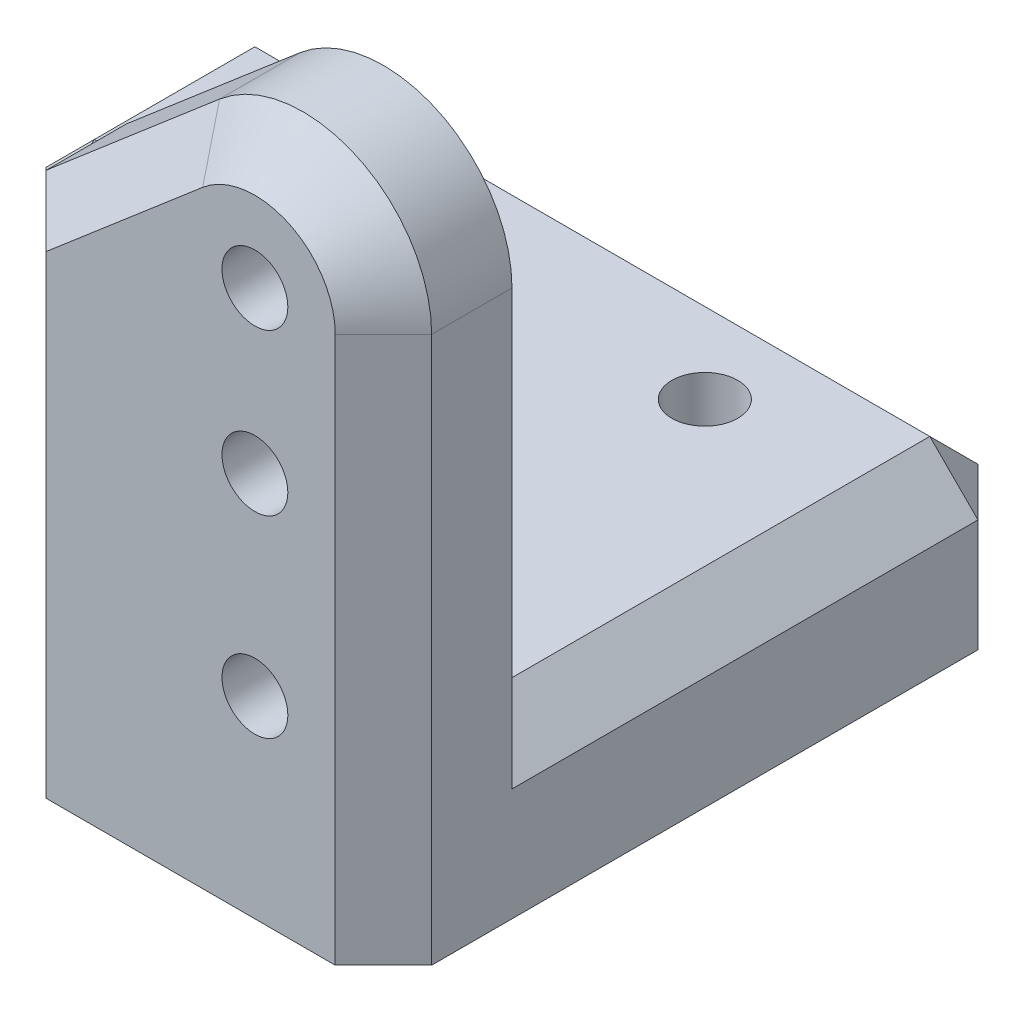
ISO-10303-21;
HEADER;
FILE_DESCRIPTION(('STEP AP214'),'2;1');
FILE_NAME('part.step','',(''),(''),'','','');
FILE_SCHEMA(('AUTOMOTIVE_DESIGN { 1 0 10303 214 1 1 1 1 }'));
ENDSEC;
DATA;
#1=APPLICATION_CONTEXT('core data for automotive mechanical design processes');
#2=APPLICATION_PROTOCOL_DEFINITION('international standard','automotive_design',2000,#1);
#3=PRODUCT_CONTEXT('',#1,'mechanical');
#4=PRODUCT('Part','Part','',(#3));
#5=PRODUCT_RELATED_PRODUCT_CATEGORY('part','',(#4));
#6=PRODUCT_DEFINITION_FORMATION('','',#4);
#7=PRODUCT_DEFINITION_CONTEXT('part definition',#1,'design');
#8=PRODUCT_DEFINITION('design','',#6,#7);
#9=PRODUCT_DEFINITION_SHAPE('','',#8);
#10=(LENGTH_UNIT() NAMED_UNIT(*) SI_UNIT(.MILLI.,.METRE.));
#11=(NAMED_UNIT(*) PLANE_ANGLE_UNIT() SI_UNIT($,.RADIAN.));
#12=(NAMED_UNIT(*) SI_UNIT($,.STERADIAN.) SOLID_ANGLE_UNIT());
#13=UNCERTAINTY_MEASURE_WITH_UNIT(LENGTH_MEASURE(1.E-05),#10,'distance_accuracy_value','');
#14=(GEOMETRIC_REPRESENTATION_CONTEXT(3) GLOBAL_UNCERTAINTY_ASSIGNED_CONTEXT((#13)) GLOBAL_UNIT_ASSIGNED_CONTEXT((#10,
#11,#12)) REPRESENTATION_CONTEXT('',''));
#15=CARTESIAN_POINT('',(0.,0.,0.));
#16=DIRECTION('',(0.,0.,1.));
#17=DIRECTION('',(1.,0.,0.));
#18=AXIS2_PLACEMENT_3D('',#15,#16,#17);
#19=CARTESIAN_POINT('',(12.,17.,20.));
#20=DIRECTION('',(0.,0.,-1.));
#21=DIRECTION('',(-1.,0.,0.));
#22=AXIS2_PLACEMENT_3D('',#19,#20,#21);
#23=PLANE('',#22);
#24=CARTESIAN_POINT('',(12.,6.,20.));
#25=DIRECTION('',(0.,0.,1.));
#26=DIRECTION('',(1.,0.,0.));
#27=AXIS2_PLACEMENT_3D('',#24,#25,#26);
#28=CIRCLE('',#27,1.025);
#29=CARTESIAN_POINT('',(13.025,6.,20.));
#30=VERTEX_POINT('',#29);
#31=EDGE_CURVE('E189',#30,#30,#28,.T.);
#32=ORIENTED_EDGE('',*,*,#31,.F.);
#33=EDGE_LOOP('',(#32));
#34=FACE_BOUND('',#33,.T.);
#35=CARTESIAN_POINT('',(12.,17.,20.));
#36=DIRECTION('',(0.,0.,1.));
#37=DIRECTION('',(1.,0.,0.));
#38=AXIS2_PLACEMENT_3D('',#35,#36,#37);
#39=CIRCLE('',#38,1.025);
#40=CARTESIAN_POINT('',(13.025,17.,20.));
#41=VERTEX_POINT('',#40);
#42=EDGE_CURVE('E354',#41,#41,#39,.T.);
#43=ORIENTED_EDGE('',*,*,#42,.F.);
#44=EDGE_LOOP('',(#43));
#45=FACE_BOUND('',#44,.T.);
#46=DIRECTION('',(1.,0.,0.));
#47=VECTOR('',#46,1.);
#48=CARTESIAN_POINT('',(16.,0.,20.));
#49=LINE('',#48,#47);
#50=CARTESIAN_POINT('',(5.50000000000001,0.,20.));
#51=VERTEX_POINT('',#50);
#52=CARTESIAN_POINT('',(14.5,0.,20.));
#53=VERTEX_POINT('',#52);
#54=EDGE_CURVE('E213',#51,#53,#49,.T.);
#55=ORIENTED_EDGE('',*,*,#54,.T.);
#56=DIRECTION('',(0.,1.,0.));
#57=VECTOR('',#56,1.);
#58=CARTESIAN_POINT('',(14.5,17.,20.));
#59=LINE('',#58,#57);
#60=CARTESIAN_POINT('',(14.5,17.,20.));
#61=VERTEX_POINT('',#60);
#62=EDGE_CURVE('E231',#53,#61,#59,.T.);
#63=ORIENTED_EDGE('',*,*,#62,.T.);
#64=CARTESIAN_POINT('',(12.,17.,20.));
#65=DIRECTION('',(0.,0.,-1.));
#66=DIRECTION('',(-1.,0.,0.));
#67=AXIS2_PLACEMENT_3D('',#64,#65,#66);
#68=CIRCLE('',#67,2.49999999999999);
#69=CARTESIAN_POINT('',(10.37505052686,18.899878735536,20.));
#70=VERTEX_POINT('',#69);
#71=EDGE_CURVE('E229',#61,#70,#68,.F.);
#72=ORIENTED_EDGE('',*,*,#71,.T.);
#73=DIRECTION('',(-0.759951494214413,-0.649979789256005,0.));
#74=VECTOR('',#73,1.);
#75=CARTESIAN_POINT('',(10.37505052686,18.899878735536,20.));
#76=LINE('',#75,#74);
#77=CARTESIAN_POINT('',(5.50000000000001,14.7302911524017,20.));
#78=VERTEX_POINT('',#77);
#79=EDGE_CURVE('E227',#70,#78,#76,.T.);
#80=ORIENTED_EDGE('',*,*,#79,.T.);
#81=DIRECTION('',(0.,-1.,0.));
#82=VECTOR('',#81,1.);
#83=CARTESIAN_POINT('',(5.50000000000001,17.,20.));
#84=LINE('',#83,#82);
#85=EDGE_CURVE('E225',#78,#51,#84,.T.);
#86=ORIENTED_EDGE('',*,*,#85,.T.);
#87=EDGE_LOOP('',(#55,#63,#72,#80,#86));
#88=FACE_BOUND('',#87,.T.);
#89=CARTESIAN_POINT('',(12.,12.,20.));
#90=DIRECTION('',(0.,0.,1.));
#91=DIRECTION('',(1.,0.,0.));
#92=AXIS2_PLACEMENT_3D('',#89,#90,#91);
#93=CIRCLE('',#92,1.025);
#94=CARTESIAN_POINT('',(13.025,12.,20.));
#95=VERTEX_POINT('',#94);
#96=EDGE_CURVE('E188',#95,#95,#93,.T.);
#97=ORIENTED_EDGE('',*,*,#96,.F.);
#98=EDGE_LOOP('',(#97));
#99=FACE_BOUND('',#98,.T.);
#100=ADVANCED_FACE('F40',(#34,#45,#88,#99),#23,.F.);
#101=CARTESIAN_POINT('',(-4.,5.,0.));
#102=DIRECTION('',(0.,-1.,0.));
#103=DIRECTION('',(0.,0.,-1.));
#104=AXIS2_PLACEMENT_3D('',#101,#102,#103);
#105=PLANE('',#104);
#106=CARTESIAN_POINT('',(-2.,5.,4.00000000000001));
#107=DIRECTION('',(0.,-1.,0.));
#108=DIRECTION('',(0.,0.,-1.));
#109=AXIS2_PLACEMENT_3D('',#106,#107,#108);
#110=CIRCLE('',#109,1.02499999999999);
#111=CARTESIAN_POINT('',(-2.,5.,2.97500000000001));
#112=VERTEX_POINT('',#111);
#113=EDGE_CURVE('E882',#112,#112,#110,.T.);
#114=ORIENTED_EDGE('',*,*,#113,.T.);
#115=EDGE_LOOP('',(#114));
#116=FACE_BOUND('',#115,.T.);
#117=CARTESIAN_POINT('',(10.,5.,4.00000000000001));
#118=DIRECTION('',(0.,-1.,0.));
#119=DIRECTION('',(0.,0.,-1.));
#120=AXIS2_PLACEMENT_3D('',#117,#118,#119);
#121=CIRCLE('',#120,1.02499999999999);
#122=CARTESIAN_POINT('',(10.,5.,2.97500000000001));
#123=VERTEX_POINT('',#122);
#124=EDGE_CURVE('E888',#123,#123,#121,.T.);
#125=ORIENTED_EDGE('',*,*,#124,.T.);
#126=EDGE_LOOP('',(#125));
#127=FACE_BOUND('',#126,.T.);
#128=CARTESIAN_POINT('',(10.,5.,14.));
#129=DIRECTION('',(0.,-1.,0.));
#130=DIRECTION('',(0.,0.,-1.));
#131=AXIS2_PLACEMENT_3D('',#128,#129,#130);
#132=CIRCLE('',#131,1.02499999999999);
#133=CARTESIAN_POINT('',(10.,5.,12.975));
#134=VERTEX_POINT('',#133);
#135=EDGE_CURVE('E313',#134,#134,#132,.T.);
#136=ORIENTED_EDGE('',*,*,#135,.T.);
#137=EDGE_LOOP('',(#136));
#138=FACE_BOUND('',#137,.T.);
#139=DIRECTION('',(1.,0.,0.));
#140=VECTOR('',#139,1.);
#141=CARTESIAN_POINT('',(-4.,5.,16.));
#142=LINE('',#141,#140);
#143=CARTESIAN_POINT('',(5.50000000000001,5.,16.));
#144=VERTEX_POINT('',#143);
#145=CARTESIAN_POINT('',(11.775,5.,16.));
#146=VERTEX_POINT('',#145);
#147=EDGE_CURVE('E201',#144,#146,#142,.T.);
#148=ORIENTED_EDGE('',*,*,#147,.T.);
#149=CARTESIAN_POINT('',(12.225,5.,16.));
#150=VERTEX_POINT('',#149);
#151=EDGE_CURVE('E187',#146,#150,#142,.T.);
#152=ORIENTED_EDGE('',*,*,#151,.T.);
#153=CARTESIAN_POINT('',(14.5,5.,16.));
#154=VERTEX_POINT('',#153);
#155=EDGE_CURVE('E192',#150,#154,#142,.T.);
#156=ORIENTED_EDGE('',*,*,#155,.T.);
#157=DIRECTION('',(0.,0.,-1.));
#158=VECTOR('',#157,1.);
#159=CARTESIAN_POINT('',(14.5,5.,0.));
#160=LINE('',#159,#158);
#161=CARTESIAN_POINT('',(14.5,5.,1.5));
#162=VERTEX_POINT('',#161);
#163=EDGE_CURVE('E271',#154,#162,#160,.T.);
#164=ORIENTED_EDGE('',*,*,#163,.T.);
#165=DIRECTION('',(-1.,0.,0.));
#166=VECTOR('',#165,1.);
#167=CARTESIAN_POINT('',(-8.,5.,1.5));
#168=LINE('',#167,#166);
#169=CARTESIAN_POINT('',(-6.50000000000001,5.,1.5));
#170=VERTEX_POINT('',#169);
#171=EDGE_CURVE('E269',#162,#170,#168,.T.);
#172=ORIENTED_EDGE('',*,*,#171,.T.);
#173=DIRECTION('',(0.,0.,1.));
#174=VECTOR('',#173,1.);
#175=CARTESIAN_POINT('',(-6.50000000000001,5.,0.));
#176=LINE('',#175,#174);
#177=CARTESIAN_POINT('',(-6.50000000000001,5.,6.50000000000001));
#178=VERTEX_POINT('',#177);
#179=EDGE_CURVE('E267',#170,#178,#176,.T.);
#180=ORIENTED_EDGE('',*,*,#179,.T.);
#181=DIRECTION('',(1.,0.,0.));
#182=VECTOR('',#181,1.);
#183=CARTESIAN_POINT('',(-4.,5.,6.50000000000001));
#184=LINE('',#183,#182);
#185=CARTESIAN_POINT('',(2.5,5.,6.50000000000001));
#186=VERTEX_POINT('',#185);
#187=EDGE_CURVE('E265',#178,#186,#184,.T.);
#188=ORIENTED_EDGE('',*,*,#187,.T.);
#189=DIRECTION('',(-0.707106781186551,0.,-0.707106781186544));
#190=VECTOR('',#189,1.);
#191=CARTESIAN_POINT('',(2.5,5.,6.50000000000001));
#192=LINE('',#191,#190);
#193=CARTESIAN_POINT('',(4.,5.,8.));
#194=VERTEX_POINT('',#193);
#195=EDGE_CURVE('E262',#194,#186,#192,.T.);
#196=ORIENTED_EDGE('',*,*,#195,.F.);
#197=DIRECTION('',(-0.707106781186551,0.,-0.707106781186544));
#198=VECTOR('',#197,1.);
#199=CARTESIAN_POINT('',(2.5,5.,6.50000000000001));
#200=LINE('',#199,#198);
#201=CARTESIAN_POINT('',(5.50000000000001,5.,9.49999999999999));
#202=VERTEX_POINT('',#201);
#203=EDGE_CURVE('E259',#202,#194,#200,.T.);
#204=ORIENTED_EDGE('',*,*,#203,.F.);
#205=DIRECTION('',(0.,0.,1.));
#206=VECTOR('',#205,1.);
#207=CARTESIAN_POINT('',(5.50000000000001,5.,0.));
#208=LINE('',#207,#206);
#209=EDGE_CURVE('E247',#202,#144,#208,.T.);
#210=ORIENTED_EDGE('',*,*,#209,.T.);
#211=EDGE_LOOP('',(#148,#152,#156,#164,#172,#180,#188,#196,#204,#210));
#212=FACE_BOUND('',#211,.T.);
#213=ADVANCED_FACE('F202',(#116,#127,#138,#212),#105,.F.);
#214=CARTESIAN_POINT('',(4.,0.,0.));
#215=DIRECTION('',(1.,0.,0.));
#216=DIRECTION('',(0.,0.,-1.));
#217=AXIS2_PLACEMENT_3D('',#214,#215,#216);
#218=PLANE('',#217);
#219=DIRECTION('',(0.,1.,0.));
#220=VECTOR('',#219,1.);
#221=CARTESIAN_POINT('',(4.,5.,16.));
#222=LINE('',#221,#220);
#223=CARTESIAN_POINT('',(4.,3.50000000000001,16.));
#224=VERTEX_POINT('',#223);
#225=CARTESIAN_POINT('',(4.,15.4211646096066,16.));
#226=VERTEX_POINT('',#225);
#227=EDGE_CURVE('E63',#224,#226,#222,.T.);
#228=ORIENTED_EDGE('',*,*,#227,.F.);
#229=DIRECTION('',(0.,0.,-1.));
#230=VECTOR('',#229,1.);
#231=CARTESIAN_POINT('',(4.,3.50000000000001,0.));
#232=LINE('',#231,#230);
#233=CARTESIAN_POINT('',(4.,3.50000000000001,9.49999999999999));
#234=VERTEX_POINT('',#233);
#235=EDGE_CURVE('E304',#224,#234,#232,.T.);
#236=ORIENTED_EDGE('',*,*,#235,.T.);
#237=DIRECTION('',(0.,-1.,0.));
#238=VECTOR('',#237,1.);
#239=CARTESIAN_POINT('',(4.,0.,9.49999999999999));
#240=LINE('',#239,#238);
#241=CARTESIAN_POINT('',(4.,0.,9.49999999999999));
#242=VERTEX_POINT('',#241);
#243=EDGE_CURVE('E302',#234,#242,#240,.T.);
#244=ORIENTED_EDGE('',*,*,#243,.T.);
#245=DIRECTION('',(0.,0.,1.));
#246=VECTOR('',#245,1.);
#247=CARTESIAN_POINT('',(4.,0.,0.));
#248=LINE('',#247,#246);
#249=CARTESIAN_POINT('',(4.,0.,18.5));
#250=VERTEX_POINT('',#249);
#251=EDGE_CURVE('E257',#242,#250,#248,.T.);
#252=ORIENTED_EDGE('',*,*,#251,.T.);
#253=DIRECTION('',(0.,1.,0.));
#254=VECTOR('',#253,1.);
#255=CARTESIAN_POINT('',(4.,0.,18.5));
#256=LINE('',#255,#254);
#257=CARTESIAN_POINT('',(4.,15.4211646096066,18.5));
#258=VERTEX_POINT('',#257);
#259=EDGE_CURVE('E245',#250,#258,#256,.T.);
#260=ORIENTED_EDGE('',*,*,#259,.T.);
#261=DIRECTION('',(0.,0.,1.));
#262=VECTOR('',#261,1.);
#263=CARTESIAN_POINT('',(4.,15.4211646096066,0.));
#264=LINE('',#263,#262);
#265=EDGE_CURVE('E363',#226,#258,#264,.T.);
#266=ORIENTED_EDGE('',*,*,#265,.F.);
#267=EDGE_LOOP('',(#228,#236,#244,#252,#260,#266));
#268=FACE_BOUND('',#267,.T.);
#269=ADVANCED_FACE('F428',(#268),#218,.F.);
#270=CARTESIAN_POINT('',(16.,0.,20.));
#271=DIRECTION('',(0.,1.,0.));
#272=DIRECTION('',(0.,0.,1.));
#273=AXIS2_PLACEMENT_3D('',#270,#271,#272);
#274=PLANE('',#273);
#275=CARTESIAN_POINT('',(-2.,0.,4.00000000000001));
#276=DIRECTION('',(0.,-1.,0.));
#277=DIRECTION('',(0.,0.,-1.));
#278=AXIS2_PLACEMENT_3D('',#275,#276,#277);
#279=CIRCLE('',#278,1.02499999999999);
#280=CARTESIAN_POINT('',(-2.,0.,2.97500000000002));
#281=VERTEX_POINT('',#280);
#282=EDGE_CURVE('E876',#281,#281,#279,.T.);
#283=ORIENTED_EDGE('',*,*,#282,.F.);
#284=EDGE_LOOP('',(#283));
#285=FACE_BOUND('',#284,.T.);
#286=CARTESIAN_POINT('',(10.,0.,4.00000000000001));
#287=DIRECTION('',(0.,-1.,0.));
#288=DIRECTION('',(0.,0.,-1.));
#289=AXIS2_PLACEMENT_3D('',#286,#287,#288);
#290=CIRCLE('',#289,1.02499999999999);
#291=CARTESIAN_POINT('',(10.,0.,2.97500000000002));
#292=VERTEX_POINT('',#291);
#293=EDGE_CURVE('E885',#292,#292,#290,.T.);
#294=ORIENTED_EDGE('',*,*,#293,.F.);
#295=EDGE_LOOP('',(#294));
#296=FACE_BOUND('',#295,.T.);
#297=CARTESIAN_POINT('',(10.,0.,14.));
#298=DIRECTION('',(0.,-1.,0.));
#299=DIRECTION('',(0.,0.,-1.));
#300=AXIS2_PLACEMENT_3D('',#297,#298,#299);
#301=CIRCLE('',#300,1.02499999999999);
#302=CARTESIAN_POINT('',(10.,0.,12.975));
#303=VERTEX_POINT('',#302);
#304=EDGE_CURVE('E890',#303,#303,#301,.T.);
#305=ORIENTED_EDGE('',*,*,#304,.F.);
#306=EDGE_LOOP('',(#305));
#307=FACE_BOUND('',#306,.T.);
#308=DIRECTION('',(1.,0.,0.));
#309=VECTOR('',#308,1.);
#310=CARTESIAN_POINT('',(16.,0.,0.));
#311=LINE('',#310,#309);
#312=CARTESIAN_POINT('',(-6.50000000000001,0.,0.));
#313=VERTEX_POINT('',#312);
#314=CARTESIAN_POINT('',(14.5,0.,0.));
#315=VERTEX_POINT('',#314);
#316=EDGE_CURVE('E212',#313,#315,#311,.T.);
#317=ORIENTED_EDGE('',*,*,#316,.T.);
#318=DIRECTION('',(0.707106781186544,0.,0.707106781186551));
#319=VECTOR('',#318,1.);
#320=CARTESIAN_POINT('',(16.,0.,1.5));
#321=LINE('',#320,#319);
#322=CARTESIAN_POINT('',(16.,0.,1.5));
#323=VERTEX_POINT('',#322);
#324=EDGE_CURVE('E288',#315,#323,#321,.T.);
#325=ORIENTED_EDGE('',*,*,#324,.T.);
#326=DIRECTION('',(0.,0.,-1.));
#327=VECTOR('',#326,1.);
#328=CARTESIAN_POINT('',(16.,0.,20.));
#329=LINE('',#328,#327);
#330=CARTESIAN_POINT('',(16.,0.,18.5));
#331=VERTEX_POINT('',#330);
#332=EDGE_CURVE('E222',#331,#323,#329,.T.);
#333=ORIENTED_EDGE('',*,*,#332,.F.);
#334=DIRECTION('',(0.707106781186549,0.,-0.707106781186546));
#335=VECTOR('',#334,1.);
#336=CARTESIAN_POINT('',(14.5,0.,20.));
#337=LINE('',#336,#335);
#338=EDGE_CURVE('E239',#331,#53,#337,.F.);
#339=ORIENTED_EDGE('',*,*,#338,.T.);
#340=ORIENTED_EDGE('',*,*,#54,.F.);
#341=DIRECTION('',(0.707106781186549,0.,0.707106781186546));
#342=VECTOR('',#341,1.);
#343=CARTESIAN_POINT('',(4.,0.,18.5));
#344=LINE('',#343,#342);
#345=EDGE_CURVE('E236',#51,#250,#344,.F.);
#346=ORIENTED_EDGE('',*,*,#345,.T.);
#347=ORIENTED_EDGE('',*,*,#251,.F.);
#348=DIRECTION('',(0.707106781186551,0.,0.707106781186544));
#349=VECTOR('',#348,1.);
#350=CARTESIAN_POINT('',(15.2500000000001,0.,20.75));
#351=LINE('',#350,#349);
#352=CARTESIAN_POINT('',(2.5,0.,8.));
#353=VERTEX_POINT('',#352);
#354=EDGE_CURVE('E49',#242,#353,#351,.F.);
#355=ORIENTED_EDGE('',*,*,#354,.T.);
#356=DIRECTION('',(1.,0.,0.));
#357=VECTOR('',#356,1.);
#358=CARTESIAN_POINT('',(-8.,0.,8.));
#359=LINE('',#358,#357);
#360=CARTESIAN_POINT('',(-6.5,0.,8.));
#361=VERTEX_POINT('',#360);
#362=EDGE_CURVE('E348',#361,#353,#359,.T.);
#363=ORIENTED_EDGE('',*,*,#362,.F.);
#364=DIRECTION('',(0.707106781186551,0.,0.707106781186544));
#365=VECTOR('',#364,1.);
#366=CARTESIAN_POINT('',(-8.,0.,6.50000000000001));
#367=LINE('',#366,#365);
#368=CARTESIAN_POINT('',(-8.,0.,6.50000000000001));
#369=VERTEX_POINT('',#368);
#370=EDGE_CURVE('E284',#361,#369,#367,.F.);
#371=ORIENTED_EDGE('',*,*,#370,.T.);
#372=DIRECTION('',(0.,0.,1.));
#373=VECTOR('',#372,1.);
#374=CARTESIAN_POINT('',(-8.,0.,8.));
#375=LINE('',#374,#373);
#376=CARTESIAN_POINT('',(-8.,0.,1.5));
#377=VERTEX_POINT('',#376);
#378=EDGE_CURVE('E344',#377,#369,#375,.T.);
#379=ORIENTED_EDGE('',*,*,#378,.F.);
#380=DIRECTION('',(0.707106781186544,0.,-0.707106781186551));
#381=VECTOR('',#380,1.);
#382=CARTESIAN_POINT('',(-8.,0.,1.5));
#383=LINE('',#382,#381);
#384=EDGE_CURVE('E286',#377,#313,#383,.T.);
#385=ORIENTED_EDGE('',*,*,#384,.T.);
#386=EDGE_LOOP('',(#317,#325,#333,#339,#340,#346,#347,#355,#363,#371,#379,#385));
#387=FACE_BOUND('',#386,.T.);
#388=ADVANCED_FACE('F404',(#285,#296,#307,#387),#274,.F.);
#389=CARTESIAN_POINT('',(16.,17.,20.));
#390=DIRECTION('',(-1.,0.,0.));
#391=DIRECTION('',(0.,0.,1.));
#392=AXIS2_PLACEMENT_3D('',#389,#390,#391);
#393=PLANE('',#392);
#394=DIRECTION('',(0.,0.,1.));
#395=VECTOR('',#394,1.);
#396=CARTESIAN_POINT('',(16.,3.50000000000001,20.));
#397=LINE('',#396,#395);
#398=CARTESIAN_POINT('',(16.,3.50000000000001,1.5));
#399=VERTEX_POINT('',#398);
#400=CARTESIAN_POINT('',(16.,3.50000000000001,16.));
#401=VERTEX_POINT('',#400);
#402=EDGE_CURVE('E275',#399,#401,#397,.T.);
#403=ORIENTED_EDGE('',*,*,#402,.T.);
#404=DIRECTION('',(0.,-1.,0.));
#405=VECTOR('',#404,1.);
#406=CARTESIAN_POINT('',(16.,5.,16.));
#407=LINE('',#406,#405);
#408=CARTESIAN_POINT('',(16.,17.,16.));
#409=VERTEX_POINT('',#408);
#410=EDGE_CURVE('E199',#409,#401,#407,.T.);
#411=ORIENTED_EDGE('',*,*,#410,.F.);
#412=DIRECTION('',(0.,0.,-1.));
#413=VECTOR('',#412,1.);
#414=CARTESIAN_POINT('',(16.,17.,20.));
#415=LINE('',#414,#413);
#416=CARTESIAN_POINT('',(16.,17.,18.5));
#417=VERTEX_POINT('',#416);
#418=EDGE_CURVE('E220',#417,#409,#415,.T.);
#419=ORIENTED_EDGE('',*,*,#418,.F.);
#420=DIRECTION('',(0.,-1.,0.));
#421=VECTOR('',#420,1.);
#422=CARTESIAN_POINT('',(16.,17.,18.5));
#423=LINE('',#422,#421);
#424=EDGE_CURVE('E234',#417,#331,#423,.T.);
#425=ORIENTED_EDGE('',*,*,#424,.T.);
#426=ORIENTED_EDGE('',*,*,#332,.T.);
#427=DIRECTION('',(0.,1.,0.));
#428=VECTOR('',#427,1.);
#429=CARTESIAN_POINT('',(16.,5.,1.5));
#430=LINE('',#429,#428);
#431=EDGE_CURVE('E273',#323,#399,#430,.T.);
#432=ORIENTED_EDGE('',*,*,#431,.T.);
#433=EDGE_LOOP('',(#403,#411,#419,#425,#426,#432));
#434=FACE_BOUND('',#433,.T.);
#435=ADVANCED_FACE('F372',(#434),#393,.F.);
#436=CARTESIAN_POINT('',(12.,17.,20.));
#437=DIRECTION('',(0.,0.,-1.));
#438=DIRECTION('',(-1.,0.,0.));
#439=AXIS2_PLACEMENT_3D('',#436,#437,#438);
#440=CYLINDRICAL_SURFACE('',#439,4.);
#441=DIRECTION('',(0.,0.,-1.));
#442=VECTOR('',#441,1.);
#443=CARTESIAN_POINT('',(9.40008084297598,20.0398059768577,20.));
#444=LINE('',#443,#442);
#445=CARTESIAN_POINT('',(9.40008084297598,20.0398059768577,18.5));
#446=VERTEX_POINT('',#445);
#447=CARTESIAN_POINT('',(9.40008084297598,20.0398059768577,16.));
#448=VERTEX_POINT('',#447);
#449=EDGE_CURVE('E216',#446,#448,#444,.T.);
#450=ORIENTED_EDGE('',*,*,#449,.F.);
#451=CARTESIAN_POINT('',(12.,17.,18.5));
#452=DIRECTION('',(0.,0.,-1.));
#453=DIRECTION('',(-1.,0.,0.));
#454=AXIS2_PLACEMENT_3D('',#451,#452,#453);
#455=CIRCLE('',#454,4.);
#456=EDGE_CURVE('E241',#446,#417,#455,.T.);
#457=ORIENTED_EDGE('',*,*,#456,.T.);
#458=ORIENTED_EDGE('',*,*,#418,.T.);
#459=CARTESIAN_POINT('',(12.,17.,16.));
#460=DIRECTION('',(0.,0.,1.));
#461=DIRECTION('',(1.,0.,0.));
#462=AXIS2_PLACEMENT_3D('',#459,#460,#461);
#463=CIRCLE('',#462,4.);
#464=EDGE_CURVE('E209',#409,#448,#463,.T.);
#465=ORIENTED_EDGE('',*,*,#464,.T.);
#466=EDGE_LOOP('',(#450,#457,#458,#465));
#467=FACE_BOUND('',#466,.T.);
#468=ADVANCED_FACE('F433',(#467),#440,.T.);
#469=CARTESIAN_POINT('',(0.,12.,20.));
#470=DIRECTION('',(0.649979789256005,-0.759951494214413,0.));
#471=DIRECTION('',(0.759951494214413,0.649979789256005,0.));
#472=AXIS2_PLACEMENT_3D('',#469,#470,#471);
#473=PLANE('',#472);
#474=ORIENTED_EDGE('',*,*,#265,.T.);
#475=DIRECTION('',(0.759951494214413,0.649979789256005,0.));
#476=VECTOR('',#475,1.);
#477=CARTESIAN_POINT('',(0.,12.,18.5));
#478=LINE('',#477,#476);
#479=EDGE_CURVE('E243',#258,#446,#478,.T.);
#480=ORIENTED_EDGE('',*,*,#479,.T.);
#481=ORIENTED_EDGE('',*,*,#449,.T.);
#482=DIRECTION('',(-0.759951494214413,-0.649979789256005,0.));
#483=VECTOR('',#482,1.);
#484=CARTESIAN_POINT('',(0.,12.,16.));
#485=LINE('',#484,#483);
#486=EDGE_CURVE('E203',#448,#226,#485,.T.);
#487=ORIENTED_EDGE('',*,*,#486,.T.);
#488=EDGE_LOOP('',(#474,#480,#481,#487));
#489=FACE_BOUND('',#488,.T.);
#490=ADVANCED_FACE('F430',(#489),#473,.F.);
#491=CARTESIAN_POINT('',(12.,17.,0.));
#492=DIRECTION('',(0.,0.,-1.));
#493=DIRECTION('',(-1.,0.,0.));
#494=AXIS2_PLACEMENT_3D('',#491,#492,#493);
#495=PLANE('',#494);
#496=DIRECTION('',(1.,0.,0.));
#497=VECTOR('',#496,1.);
#498=CARTESIAN_POINT('',(16.,3.50000000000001,0.));
#499=LINE('',#498,#497);
#500=CARTESIAN_POINT('',(-6.50000000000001,3.50000000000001,0.));
#501=VERTEX_POINT('',#500);
#502=CARTESIAN_POINT('',(14.5,3.50000000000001,0.));
#503=VERTEX_POINT('',#502);
#504=EDGE_CURVE('E280',#501,#503,#499,.T.);
#505=ORIENTED_EDGE('',*,*,#504,.T.);
#506=DIRECTION('',(0.,-1.,0.));
#507=VECTOR('',#506,1.);
#508=CARTESIAN_POINT('',(14.5,0.,0.));
#509=LINE('',#508,#507);
#510=EDGE_CURVE('E282',#503,#315,#509,.T.);
#511=ORIENTED_EDGE('',*,*,#510,.T.);
#512=ORIENTED_EDGE('',*,*,#316,.F.);
#513=DIRECTION('',(0.,1.,0.));
#514=VECTOR('',#513,1.);
#515=CARTESIAN_POINT('',(-6.50000000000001,5.,0.));
#516=LINE('',#515,#514);
#517=EDGE_CURVE('E278',#313,#501,#516,.T.);
#518=ORIENTED_EDGE('',*,*,#517,.T.);
#519=EDGE_LOOP('',(#505,#511,#512,#518));
#520=FACE_BOUND('',#519,.T.);
#521=ADVANCED_FACE('F396',(#520),#495,.T.);
#522=CARTESIAN_POINT('',(-4.,5.,16.));
#523=DIRECTION('',(0.,0.,1.));
#524=DIRECTION('',(1.,0.,0.));
#525=AXIS2_PLACEMENT_3D('',#522,#523,#524);
#526=PLANE('',#525);
#527=CARTESIAN_POINT('',(12.,12.,16.));
#528=DIRECTION('',(0.,0.,1.));
#529=DIRECTION('',(1.,0.,0.));
#530=AXIS2_PLACEMENT_3D('',#527,#528,#529);
#531=CIRCLE('',#530,1.025);
#532=CARTESIAN_POINT('',(13.025,12.,16.));
#533=VERTEX_POINT('',#532);
#534=EDGE_CURVE('E467',#533,#533,#531,.T.);
#535=ORIENTED_EDGE('',*,*,#534,.T.);
#536=EDGE_LOOP('',(#535));
#537=FACE_BOUND('',#536,.T.);
#538=CARTESIAN_POINT('',(12.,17.,16.));
#539=DIRECTION('',(0.,0.,1.));
#540=DIRECTION('',(1.,0.,0.));
#541=AXIS2_PLACEMENT_3D('',#538,#539,#540);
#542=CIRCLE('',#541,1.025);
#543=CARTESIAN_POINT('',(13.025,17.,16.));
#544=VERTEX_POINT('',#543);
#545=EDGE_CURVE('E251',#544,#544,#542,.T.);
#546=ORIENTED_EDGE('',*,*,#545,.T.);
#547=EDGE_LOOP('',(#546));
#548=FACE_BOUND('',#547,.T.);
#549=ORIENTED_EDGE('',*,*,#155,.F.);
#550=CARTESIAN_POINT('',(12.,6.,16.));
#551=DIRECTION('',(0.,0.,1.));
#552=DIRECTION('',(1.,0.,0.));
#553=AXIS2_PLACEMENT_3D('',#550,#551,#552);
#554=CIRCLE('',#553,1.025);
#555=EDGE_CURVE('E11',#150,#146,#554,.T.);
#556=ORIENTED_EDGE('',*,*,#555,.T.);
#557=ORIENTED_EDGE('',*,*,#147,.F.);
#558=DIRECTION('',(0.707106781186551,0.707106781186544,0.));
#559=VECTOR('',#558,1.);
#560=CARTESIAN_POINT('',(0.749999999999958,0.249999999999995,16.));
#561=LINE('',#560,#559);
#562=EDGE_CURVE('E307',#144,#224,#561,.F.);
#563=ORIENTED_EDGE('',*,*,#562,.T.);
#564=ORIENTED_EDGE('',*,*,#227,.T.);
#565=ORIENTED_EDGE('',*,*,#486,.F.);
#566=ORIENTED_EDGE('',*,*,#464,.F.);
#567=ORIENTED_EDGE('',*,*,#410,.T.);
#568=DIRECTION('',(0.707106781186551,-0.707106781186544,0.));
#569=VECTOR('',#568,1.);
#570=CARTESIAN_POINT('',(5.24999999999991,14.25,16.));
#571=LINE('',#570,#569);
#572=EDGE_CURVE('E195',#401,#154,#571,.F.);
#573=ORIENTED_EDGE('',*,*,#572,.T.);
#574=EDGE_LOOP('',(#549,#556,#557,#563,#564,#565,#566,#567,#573));
#575=FACE_BOUND('',#574,.T.);
#576=ADVANCED_FACE('F193',(#537,#548,#575),#526,.F.);
#577=CARTESIAN_POINT('',(4.,0.,18.5));
#578=DIRECTION('',(0.707106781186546,0.,-0.707106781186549));
#579=DIRECTION('',(0.,1.,0.));
#580=AXIS2_PLACEMENT_3D('',#577,#578,#579);
#581=PLANE('',#580);
#582=ORIENTED_EDGE('',*,*,#345,.F.);
#583=ORIENTED_EDGE('',*,*,#85,.F.);
#584=DIRECTION('',(-0.67234794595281,0.309671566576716,-0.672347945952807));
#585=VECTOR('',#584,1.);
#586=CARTESIAN_POINT('',(7.2107950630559,13.9423292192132,21.7107950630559));
#587=LINE('',#586,#585);
#588=EDGE_CURVE('E254',#258,#78,#587,.F.);
#589=ORIENTED_EDGE('',*,*,#588,.F.);
#590=ORIENTED_EDGE('',*,*,#259,.F.);
#591=EDGE_LOOP('',(#582,#583,#589,#590));
#592=FACE_BOUND('',#591,.T.);
#593=ADVANCED_FACE('F425',(#592),#581,.F.);
#594=CARTESIAN_POINT('',(10.37505052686,18.899878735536,20.));
#595=DIRECTION('',(0.459605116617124,-0.53736685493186,-0.707106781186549));
#596=DIRECTION('',(-0.759951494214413,-0.649979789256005,0.));
#597=AXIS2_PLACEMENT_3D('',#594,#595,#596);
#598=PLANE('',#597);
#599=ORIENTED_EDGE('',*,*,#588,.T.);
#600=ORIENTED_EDGE('',*,*,#79,.F.);
#601=DIRECTION('',(0.459605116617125,-0.537366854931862,0.707106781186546));
#602=VECTOR('',#601,1.);
#603=CARTESIAN_POINT('',(9.40008084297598,20.0398059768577,18.5));
#604=LINE('',#603,#602);
#605=EDGE_CURVE('E250',#446,#70,#604,.T.);
#606=ORIENTED_EDGE('',*,*,#605,.F.);
#607=ORIENTED_EDGE('',*,*,#479,.F.);
#608=EDGE_LOOP('',(#599,#600,#606,#607));
#609=FACE_BOUND('',#608,.T.);
#610=ADVANCED_FACE('F462',(#609),#598,.F.);
#611=CARTESIAN_POINT('',(12.,17.,20.));
#612=DIRECTION('',(0.,0.,-1.));
#613=DIRECTION('',(-1.,0.,0.));
#614=AXIS2_PLACEMENT_3D('',#611,#612,#613);
#615=CONICAL_SURFACE('',#614,2.49999999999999,0.78539816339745);
#616=ORIENTED_EDGE('',*,*,#605,.T.);
#617=ORIENTED_EDGE('',*,*,#71,.F.);
#618=DIRECTION('',(-0.707106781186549,0.,0.707106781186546));
#619=VECTOR('',#618,1.);
#620=CARTESIAN_POINT('',(16.,17.,18.5));
#621=LINE('',#620,#619);
#622=EDGE_CURVE('E248',#417,#61,#621,.T.);
#623=ORIENTED_EDGE('',*,*,#622,.F.);
#624=ORIENTED_EDGE('',*,*,#456,.F.);
#625=EDGE_LOOP('',(#616,#617,#623,#624));
#626=FACE_BOUND('',#625,.T.);
#627=ADVANCED_FACE('F414',(#626),#615,.T.);
#628=CARTESIAN_POINT('',(14.5,17.,20.));
#629=DIRECTION('',(-0.707106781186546,0.,-0.707106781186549));
#630=DIRECTION('',(0.,1.,0.));
#631=AXIS2_PLACEMENT_3D('',#628,#629,#630);
#632=PLANE('',#631);
#633=ORIENTED_EDGE('',*,*,#338,.F.);
#634=ORIENTED_EDGE('',*,*,#424,.F.);
#635=ORIENTED_EDGE('',*,*,#622,.T.);
#636=ORIENTED_EDGE('',*,*,#62,.F.);
#637=EDGE_LOOP('',(#633,#634,#635,#636));
#638=FACE_BOUND('',#637,.T.);
#639=ADVANCED_FACE('F409',(#638),#632,.F.);
#640=CARTESIAN_POINT('',(12.,17.,20.));
#641=DIRECTION('',(0.,0.,1.));
#642=DIRECTION('',(1.,0.,0.));
#643=AXIS2_PLACEMENT_3D('',#640,#641,#642);
#644=CYLINDRICAL_SURFACE('',#643,1.025);
#645=ORIENTED_EDGE('',*,*,#42,.T.);
#646=EDGE_LOOP('',(#645));
#647=FACE_BOUND('',#646,.T.);
#648=ORIENTED_EDGE('',*,*,#545,.F.);
#649=EDGE_LOOP('',(#648));
#650=FACE_BOUND('',#649,.T.);
#651=ADVANCED_FACE('F470',(#647,#650),#644,.F.);
#652=CARTESIAN_POINT('',(-8.,5.,8.));
#653=DIRECTION('',(0.,0.,-1.));
#654=DIRECTION('',(-1.,0.,0.));
#655=AXIS2_PLACEMENT_3D('',#652,#653,#654);
#656=PLANE('',#655);
#657=DIRECTION('',(-1.,0.,0.));
#658=VECTOR('',#657,1.);
#659=CARTESIAN_POINT('',(-8.,3.49999999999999,8.));
#660=LINE('',#659,#658);
#661=CARTESIAN_POINT('',(2.5,3.49999999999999,8.));
#662=VERTEX_POINT('',#661);
#663=CARTESIAN_POINT('',(-6.5,3.49999999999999,8.));
#664=VERTEX_POINT('',#663);
#665=EDGE_CURVE('E298',#662,#664,#660,.T.);
#666=ORIENTED_EDGE('',*,*,#665,.T.);
#667=DIRECTION('',(0.,-1.,0.));
#668=VECTOR('',#667,1.);
#669=CARTESIAN_POINT('',(-6.5,5.,8.));
#670=LINE('',#669,#668);
#671=EDGE_CURVE('E300',#664,#361,#670,.T.);
#672=ORIENTED_EDGE('',*,*,#671,.T.);
#673=ORIENTED_EDGE('',*,*,#362,.T.);
#674=DIRECTION('',(0.,1.,0.));
#675=VECTOR('',#674,1.);
#676=CARTESIAN_POINT('',(2.5,5.,8.));
#677=LINE('',#676,#675);
#678=EDGE_CURVE('E296',#353,#662,#677,.T.);
#679=ORIENTED_EDGE('',*,*,#678,.T.);
#680=EDGE_LOOP('',(#666,#672,#673,#679));
#681=FACE_BOUND('',#680,.T.);
#682=ADVANCED_FACE('F472',(#681),#656,.F.);
#683=CARTESIAN_POINT('',(-8.,0.,0.));
#684=DIRECTION('',(1.,0.,0.));
#685=DIRECTION('',(0.,0.,-1.));
#686=AXIS2_PLACEMENT_3D('',#683,#684,#685);
#687=PLANE('',#686);
#688=DIRECTION('',(0.,0.,-1.));
#689=VECTOR('',#688,1.);
#690=CARTESIAN_POINT('',(-8.,3.5,0.));
#691=LINE('',#690,#689);
#692=CARTESIAN_POINT('',(-8.,3.49999999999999,6.50000000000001));
#693=VERTEX_POINT('',#692);
#694=CARTESIAN_POINT('',(-8.,3.49999999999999,1.5));
#695=VERTEX_POINT('',#694);
#696=EDGE_CURVE('E292',#693,#695,#691,.T.);
#697=ORIENTED_EDGE('',*,*,#696,.T.);
#698=DIRECTION('',(0.,-1.,0.));
#699=VECTOR('',#698,1.);
#700=CARTESIAN_POINT('',(-8.,0.,1.5));
#701=LINE('',#700,#699);
#702=EDGE_CURVE('E294',#695,#377,#701,.T.);
#703=ORIENTED_EDGE('',*,*,#702,.T.);
#704=ORIENTED_EDGE('',*,*,#378,.T.);
#705=DIRECTION('',(0.,1.,0.));
#706=VECTOR('',#705,1.);
#707=CARTESIAN_POINT('',(-8.,0.,6.50000000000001));
#708=LINE('',#707,#706);
#709=EDGE_CURVE('E290',#369,#693,#708,.T.);
#710=ORIENTED_EDGE('',*,*,#709,.T.);
#711=EDGE_LOOP('',(#697,#703,#704,#710));
#712=FACE_BOUND('',#711,.T.);
#713=ADVANCED_FACE('F479',(#712),#687,.F.);
#714=CARTESIAN_POINT('',(5.50000000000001,5.,0.));
#715=DIRECTION('',(0.707106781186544,-0.707106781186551,0.));
#716=DIRECTION('',(0.,0.,1.));
#717=AXIS2_PLACEMENT_3D('',#714,#715,#716);
#718=PLANE('',#717);
#719=ORIENTED_EDGE('',*,*,#562,.F.);
#720=ORIENTED_EDGE('',*,*,#209,.F.);
#721=DIRECTION('',(0.707106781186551,0.707106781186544,0.));
#722=VECTOR('',#721,1.);
#723=CARTESIAN_POINT('',(4.,3.50000000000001,9.49999999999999));
#724=LINE('',#723,#722);
#725=EDGE_CURVE('E342',#234,#202,#724,.T.);
#726=ORIENTED_EDGE('',*,*,#725,.F.);
#727=ORIENTED_EDGE('',*,*,#235,.F.);
#728=EDGE_LOOP('',(#719,#720,#726,#727));
#729=FACE_BOUND('',#728,.T.);
#730=ADVANCED_FACE('F43',(#729),#718,.F.);
#731=CARTESIAN_POINT('',(2.5,5.,8.));
#732=DIRECTION('',(-0.707106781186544,0.,0.707106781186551));
#733=DIRECTION('',(0.,-1.,0.));
#734=AXIS2_PLACEMENT_3D('',#731,#732,#733);
#735=PLANE('',#734);
#736=ORIENTED_EDGE('',*,*,#354,.F.);
#737=ORIENTED_EDGE('',*,*,#243,.F.);
#738=DIRECTION('',(-0.707106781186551,0.,-0.707106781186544));
#739=VECTOR('',#738,1.);
#740=CARTESIAN_POINT('',(2.5,3.49999999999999,8.));
#741=LINE('',#740,#739);
#742=EDGE_CURVE('E340',#662,#234,#741,.F.);
#743=ORIENTED_EDGE('',*,*,#742,.F.);
#744=ORIENTED_EDGE('',*,*,#678,.F.);
#745=EDGE_LOOP('',(#736,#737,#743,#744));
#746=FACE_BOUND('',#745,.T.);
#747=ADVANCED_FACE('F580',(#746),#735,.T.);
#748=CARTESIAN_POINT('',(2.5,3.49999999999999,8.));
#749=DIRECTION('',(-0.577350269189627,0.577350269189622,0.577350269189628));
#750=DIRECTION('',(0.707106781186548,0.,0.707106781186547));
#751=AXIS2_PLACEMENT_3D('',#748,#749,#750);
#752=PLANE('',#751);
#753=ORIENTED_EDGE('',*,*,#203,.T.);
#754=ORIENTED_EDGE('',*,*,#195,.T.);
#755=DIRECTION('',(0.,-0.707106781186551,0.707106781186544));
#756=VECTOR('',#755,1.);
#757=CARTESIAN_POINT('',(2.5,5.,6.50000000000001));
#758=LINE('',#757,#756);
#759=EDGE_CURVE('E337',#662,#186,#758,.F.);
#760=ORIENTED_EDGE('',*,*,#759,.F.);
#761=ORIENTED_EDGE('',*,*,#742,.T.);
#762=ORIENTED_EDGE('',*,*,#725,.T.);
#763=EDGE_LOOP('',(#753,#754,#760,#761,#762));
#764=FACE_BOUND('',#763,.T.);
#765=ADVANCED_FACE('F574',(#764),#752,.T.);
#766=CARTESIAN_POINT('',(-4.,5.,6.50000000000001));
#767=DIRECTION('',(0.,-0.707106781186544,-0.707106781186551));
#768=DIRECTION('',(1.,0.,0.));
#769=AXIS2_PLACEMENT_3D('',#766,#767,#768);
#770=PLANE('',#769);
#771=ORIENTED_EDGE('',*,*,#759,.T.);
#772=ORIENTED_EDGE('',*,*,#187,.F.);
#773=DIRECTION('',(0.,-0.707106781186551,0.707106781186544));
#774=VECTOR('',#773,1.);
#775=CARTESIAN_POINT('',(-6.50000000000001,5.,6.50000000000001));
#776=LINE('',#775,#774);
#777=EDGE_CURVE('E334',#664,#178,#776,.F.);
#778=ORIENTED_EDGE('',*,*,#777,.F.);
#779=ORIENTED_EDGE('',*,*,#665,.F.);
#780=EDGE_LOOP('',(#771,#772,#778,#779));
#781=FACE_BOUND('',#780,.T.);
#782=ADVANCED_FACE('F567',(#781),#770,.F.);
#783=CARTESIAN_POINT('',(-8.,0.,6.50000000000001));
#784=DIRECTION('',(0.707106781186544,0.,-0.707106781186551));
#785=DIRECTION('',(0.,1.,0.));
#786=AXIS2_PLACEMENT_3D('',#783,#784,#785);
#787=PLANE('',#786);
#788=ORIENTED_EDGE('',*,*,#370,.F.);
#789=ORIENTED_EDGE('',*,*,#671,.F.);
#790=DIRECTION('',(-0.707106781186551,0.,-0.707106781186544));
#791=VECTOR('',#790,1.);
#792=CARTESIAN_POINT('',(-7.25,3.49999999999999,7.25));
#793=LINE('',#792,#791);
#794=EDGE_CURVE('E331',#693,#664,#793,.F.);
#795=ORIENTED_EDGE('',*,*,#794,.F.);
#796=ORIENTED_EDGE('',*,*,#709,.F.);
#797=EDGE_LOOP('',(#788,#789,#795,#796));
#798=FACE_BOUND('',#797,.T.);
#799=ADVANCED_FACE('F560',(#798),#787,.F.);
#800=CARTESIAN_POINT('',(-6.50000000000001,5.,6.50000000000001));
#801=DIRECTION('',(-0.577350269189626,0.57735026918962,0.577350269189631));
#802=DIRECTION('',(0.707106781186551,0.,0.707106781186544));
#803=AXIS2_PLACEMENT_3D('',#800,#801,#802);
#804=PLANE('',#803);
#805=ORIENTED_EDGE('',*,*,#794,.T.);
#806=ORIENTED_EDGE('',*,*,#777,.T.);
#807=DIRECTION('',(0.707106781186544,0.707106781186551,0.));
#808=VECTOR('',#807,1.);
#809=CARTESIAN_POINT('',(-6.50000000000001,5.,6.50000000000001));
#810=LINE('',#809,#808);
#811=EDGE_CURVE('E328',#693,#178,#810,.T.);
#812=ORIENTED_EDGE('',*,*,#811,.F.);
#813=EDGE_LOOP('',(#805,#806,#812));
#814=FACE_BOUND('',#813,.T.);
#815=ADVANCED_FACE('F554',(#814),#804,.T.);
#816=CARTESIAN_POINT('',(-8.,3.5,0.));
#817=DIRECTION('',(0.707106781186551,-0.707106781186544,0.));
#818=DIRECTION('',(0.,0.,-1.));
#819=AXIS2_PLACEMENT_3D('',#816,#817,#818);
#820=PLANE('',#819);
#821=ORIENTED_EDGE('',*,*,#811,.T.);
#822=ORIENTED_EDGE('',*,*,#179,.F.);
#823=DIRECTION('',(-0.707106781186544,-0.707106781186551,0.));
#824=VECTOR('',#823,1.);
#825=CARTESIAN_POINT('',(-6.50000000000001,5.,1.5));
#826=LINE('',#825,#824);
#827=EDGE_CURVE('E325',#695,#170,#826,.F.);
#828=ORIENTED_EDGE('',*,*,#827,.F.);
#829=ORIENTED_EDGE('',*,*,#696,.F.);
#830=EDGE_LOOP('',(#821,#822,#828,#829));
#831=FACE_BOUND('',#830,.T.);
#832=ADVANCED_FACE('F385',(#831),#820,.F.);
#833=CARTESIAN_POINT('',(-8.,0.,1.5));
#834=DIRECTION('',(-0.707106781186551,0.,-0.707106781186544));
#835=DIRECTION('',(0.,1.,0.));
#836=AXIS2_PLACEMENT_3D('',#833,#834,#835);
#837=PLANE('',#836);
#838=ORIENTED_EDGE('',*,*,#384,.F.);
#839=ORIENTED_EDGE('',*,*,#702,.F.);
#840=DIRECTION('',(-0.707106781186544,0.,0.707106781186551));
#841=VECTOR('',#840,1.);
#842=CARTESIAN_POINT('',(-7.25000000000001,3.5,0.750000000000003));
#843=LINE('',#842,#841);
#844=EDGE_CURVE('E322',#501,#695,#843,.T.);
#845=ORIENTED_EDGE('',*,*,#844,.F.);
#846=ORIENTED_EDGE('',*,*,#517,.F.);
#847=EDGE_LOOP('',(#838,#839,#845,#846));
#848=FACE_BOUND('',#847,.T.);
#849=ADVANCED_FACE('F542',(#848),#837,.T.);
#850=CARTESIAN_POINT('',(-6.50000000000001,5.,1.5));
#851=DIRECTION('',(-0.577350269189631,0.577350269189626,-0.577350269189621));
#852=DIRECTION('',(-0.707106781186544,-0.707106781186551,0.));
#853=AXIS2_PLACEMENT_3D('',#850,#851,#852);
#854=PLANE('',#853);
#855=ORIENTED_EDGE('',*,*,#844,.T.);
#856=ORIENTED_EDGE('',*,*,#827,.T.);
#857=DIRECTION('',(0.,-0.707106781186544,-0.707106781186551));
#858=VECTOR('',#857,1.);
#859=CARTESIAN_POINT('',(-6.50000000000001,5.,1.5));
#860=LINE('',#859,#858);
#861=EDGE_CURVE('E319',#501,#170,#860,.F.);
#862=ORIENTED_EDGE('',*,*,#861,.F.);
#863=EDGE_LOOP('',(#855,#856,#862));
#864=FACE_BOUND('',#863,.T.);
#865=ADVANCED_FACE('F390',(#864),#854,.T.);
#866=CARTESIAN_POINT('',(-4.,5.,1.50000000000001));
#867=DIRECTION('',(0.,0.707106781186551,-0.707106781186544));
#868=DIRECTION('',(1.,0.,0.));
#869=AXIS2_PLACEMENT_3D('',#866,#867,#868);
#870=PLANE('',#869);
#871=ORIENTED_EDGE('',*,*,#861,.T.);
#872=ORIENTED_EDGE('',*,*,#171,.F.);
#873=DIRECTION('',(0.,0.707106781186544,0.707106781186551));
#874=VECTOR('',#873,1.);
#875=CARTESIAN_POINT('',(14.5,5.,1.5));
#876=LINE('',#875,#874);
#877=EDGE_CURVE('E316',#503,#162,#876,.T.);
#878=ORIENTED_EDGE('',*,*,#877,.F.);
#879=ORIENTED_EDGE('',*,*,#504,.F.);
#880=EDGE_LOOP('',(#871,#872,#878,#879));
#881=FACE_BOUND('',#880,.T.);
#882=ADVANCED_FACE('F393',(#881),#870,.T.);
#883=CARTESIAN_POINT('',(16.,17.,1.5));
#884=DIRECTION('',(0.707106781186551,0.,-0.707106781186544));
#885=DIRECTION('',(0.,-1.,0.));
#886=AXIS2_PLACEMENT_3D('',#883,#884,#885);
#887=PLANE('',#886);
#888=ORIENTED_EDGE('',*,*,#324,.F.);
#889=ORIENTED_EDGE('',*,*,#510,.F.);
#890=DIRECTION('',(-0.707106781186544,0.,-0.707106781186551));
#891=VECTOR('',#890,1.);
#892=CARTESIAN_POINT('',(15.25,3.50000000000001,0.750000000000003));
#893=LINE('',#892,#891);
#894=EDGE_CURVE('E312',#399,#503,#893,.T.);
#895=ORIENTED_EDGE('',*,*,#894,.F.);
#896=ORIENTED_EDGE('',*,*,#431,.F.);
#897=EDGE_LOOP('',(#888,#889,#895,#896));
#898=FACE_BOUND('',#897,.T.);
#899=ADVANCED_FACE('F401',(#898),#887,.T.);
#900=CARTESIAN_POINT('',(14.5,5.,1.5));
#901=DIRECTION('',(0.577350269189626,0.577350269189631,-0.577350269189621));
#902=DIRECTION('',(-0.707106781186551,0.707106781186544,0.));
#903=AXIS2_PLACEMENT_3D('',#900,#901,#902);
#904=PLANE('',#903);
#905=ORIENTED_EDGE('',*,*,#894,.T.);
#906=ORIENTED_EDGE('',*,*,#877,.T.);
#907=DIRECTION('',(-0.707106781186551,0.707106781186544,0.));
#908=VECTOR('',#907,1.);
#909=CARTESIAN_POINT('',(14.5,5.,1.5));
#910=LINE('',#909,#908);
#911=EDGE_CURVE('E310',#399,#162,#910,.T.);
#912=ORIENTED_EDGE('',*,*,#911,.F.);
#913=EDGE_LOOP('',(#905,#906,#912));
#914=FACE_BOUND('',#913,.T.);
#915=ADVANCED_FACE('F520',(#914),#904,.T.);
#916=CARTESIAN_POINT('',(14.5,5.,0.));
#917=DIRECTION('',(-0.707106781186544,-0.707106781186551,0.));
#918=DIRECTION('',(0.,0.,-1.));
#919=AXIS2_PLACEMENT_3D('',#916,#917,#918);
#920=PLANE('',#919);
#921=ORIENTED_EDGE('',*,*,#572,.F.);
#922=ORIENTED_EDGE('',*,*,#402,.F.);
#923=ORIENTED_EDGE('',*,*,#911,.T.);
#924=ORIENTED_EDGE('',*,*,#163,.F.);
#925=EDGE_LOOP('',(#921,#922,#923,#924));
#926=FACE_BOUND('',#925,.T.);
#927=ADVANCED_FACE('F377',(#926),#920,.F.);
#928=CARTESIAN_POINT('',(10.,0.,14.));
#929=DIRECTION('',(0.,-1.,0.));
#930=DIRECTION('',(0.,0.,-1.));
#931=AXIS2_PLACEMENT_3D('',#928,#929,#930);
#932=CYLINDRICAL_SURFACE('',#931,1.02499999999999);
#933=ORIENTED_EDGE('',*,*,#304,.T.);
#934=EDGE_LOOP('',(#933));
#935=FACE_BOUND('',#934,.T.);
#936=ORIENTED_EDGE('',*,*,#135,.F.);
#937=EDGE_LOOP('',(#936));
#938=FACE_BOUND('',#937,.T.);
#939=ADVANCED_FACE('F519',(#935,#938),#932,.F.);
#940=CARTESIAN_POINT('',(10.,0.,4.00000000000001));
#941=DIRECTION('',(0.,-1.,0.));
#942=DIRECTION('',(0.,0.,-1.));
#943=AXIS2_PLACEMENT_3D('',#940,#941,#942);
#944=CYLINDRICAL_SURFACE('',#943,1.02499999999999);
#945=ORIENTED_EDGE('',*,*,#293,.T.);
#946=EDGE_LOOP('',(#945));
#947=FACE_BOUND('',#946,.T.);
#948=ORIENTED_EDGE('',*,*,#124,.F.);
#949=EDGE_LOOP('',(#948));
#950=FACE_BOUND('',#949,.T.);
#951=ADVANCED_FACE('F607',(#947,#950),#944,.F.);
#952=CARTESIAN_POINT('',(-2.,0.,4.00000000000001));
#953=DIRECTION('',(0.,-1.,0.));
#954=DIRECTION('',(0.,0.,-1.));
#955=AXIS2_PLACEMENT_3D('',#952,#953,#954);
#956=CYLINDRICAL_SURFACE('',#955,1.02499999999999);
#957=ORIENTED_EDGE('',*,*,#282,.T.);
#958=EDGE_LOOP('',(#957));
#959=FACE_BOUND('',#958,.T.);
#960=ORIENTED_EDGE('',*,*,#113,.F.);
#961=EDGE_LOOP('',(#960));
#962=FACE_BOUND('',#961,.T.);
#963=ADVANCED_FACE('F611',(#959,#962),#956,.F.);
#964=CARTESIAN_POINT('',(12.,12.,20.));
#965=DIRECTION('',(0.,0.,1.));
#966=DIRECTION('',(1.,0.,0.));
#967=AXIS2_PLACEMENT_3D('',#964,#965,#966);
#968=CYLINDRICAL_SURFACE('',#967,1.025);
#969=ORIENTED_EDGE('',*,*,#534,.F.);
#970=EDGE_LOOP('',(#969));
#971=FACE_BOUND('',#970,.T.);
#972=ORIENTED_EDGE('',*,*,#96,.T.);
#973=EDGE_LOOP('',(#972));
#974=FACE_BOUND('',#973,.T.);
#975=ADVANCED_FACE('F615',(#971,#974),#968,.F.);
#976=CARTESIAN_POINT('',(12.,6.,20.));
#977=DIRECTION('',(0.,0.,1.));
#978=DIRECTION('',(1.,0.,0.));
#979=AXIS2_PLACEMENT_3D('',#976,#977,#978);
#980=CYLINDRICAL_SURFACE('',#979,1.025);
#981=CARTESIAN_POINT('',(12.,6.,16.));
#982=DIRECTION('',(0.,0.,1.));
#983=DIRECTION('',(1.,0.,0.));
#984=AXIS2_PLACEMENT_3D('',#981,#982,#983);
#985=CIRCLE('',#984,1.025);
#986=EDGE_CURVE('E55',#150,#146,#985,.F.);
#987=ORIENTED_EDGE('',*,*,#986,.T.);
#988=ORIENTED_EDGE('',*,*,#555,.F.);
#989=EDGE_LOOP('',(#987,#988));
#990=FACE_BOUND('',#989,.T.);
#991=ORIENTED_EDGE('',*,*,#31,.T.);
#992=EDGE_LOOP('',(#991));
#993=FACE_BOUND('',#992,.T.);
#994=ADVANCED_FACE('F178',(#990,#993),#980,.F.);
#995=CARTESIAN_POINT('',(-4.,5.,16.));
#996=DIRECTION('',(0.,0.,1.));
#997=DIRECTION('',(1.,0.,0.));
#998=AXIS2_PLACEMENT_3D('',#995,#996,#997);
#999=PLANE('',#998);
#1000=ORIENTED_EDGE('',*,*,#986,.F.);
#1001=ORIENTED_EDGE('',*,*,#151,.F.);
#1002=EDGE_LOOP('',(#1000,#1001));
#1003=FACE_BOUND('',#1002,.T.);
#1004=ADVANCED_FACE('F185',(#1003),#999,.T.);
#1005=CLOSED_SHELL('',(#100,#213,#269,#388,#435,#468,#490,#521,#576,#593,#610,#627,#639,#651,
#682,#713,#730,#747,#765,#782,#799,#815,#832,#849,#865,#882,#899,#915,#927,#939,#951,#963,#975,
#994,#1004));
#1006=MANIFOLD_SOLID_BREP('B2',#1005);
#1007=ADVANCED_BREP_SHAPE_REPRESENTATION('',(#18,#1006),#14);
#1008=SHAPE_DEFINITION_REPRESENTATION(#9,#1007);
ENDSEC;
END-ISO-10303-21;
